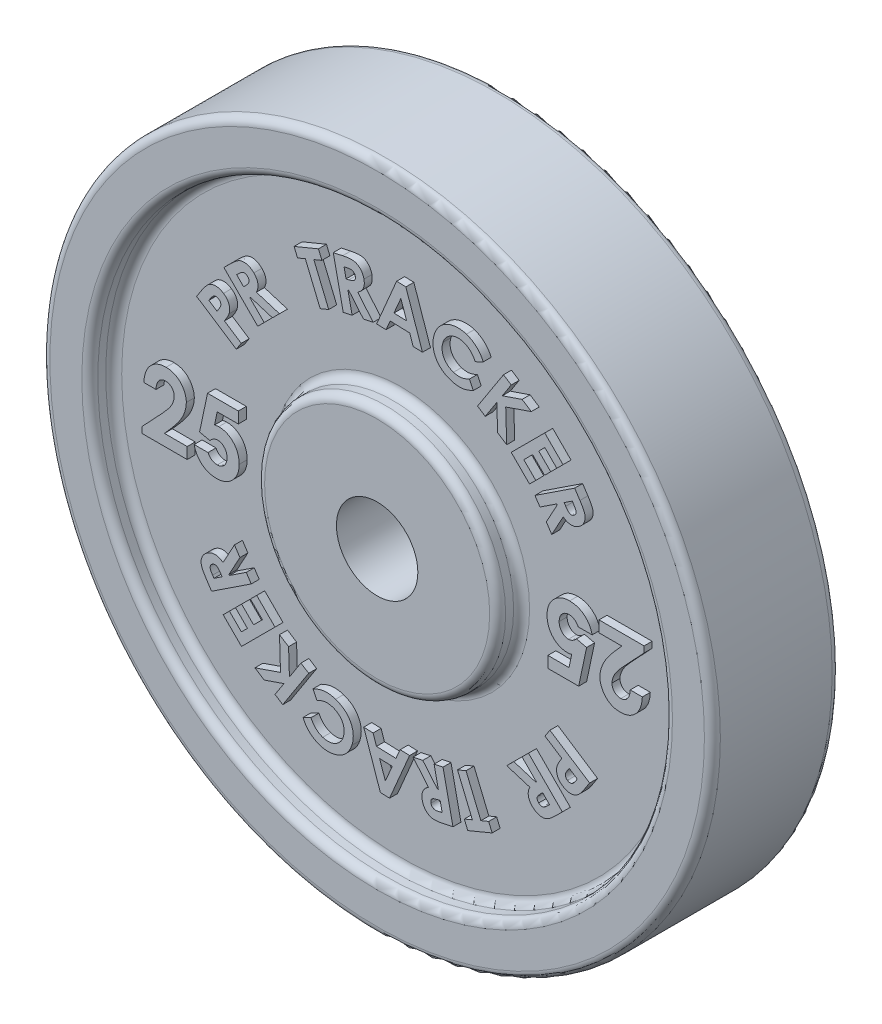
from build123d import *

# Parameters (mm, degrees)
ESBO_O1_R                = 21
ESBO_O1_R_2              = 2.55
RESSALTO_EXTRUS_O1_DEPTH = 8
ESBO_O2_R                = 18
ESBO_O2_R_2              = 7.55
CORTE_EXTRUS_O1_DEPTH    = 1.5
FILETE1_R                = 0.5
RESSALTO_EXTRUS_O2_DEPTH = 0.5
RESSALTO_EXTRUS_O3_DEPTH = 0.5
PADR_OCIRCULAR1_COUNT    = 2
FILETE2_R                = 0.5
FILETE3_R                = 0.5
RESSALTO_EXTRUS_O4_DEPTH = 0.5
RESSALTO_EXTRUS_O5_DEPTH = 0.5
PADR_OCIRCULAR2_COUNT    = 2


with BuildPart() as part:
    # Esbo_o1 → Ressalto-extrus_o1 (new body)
    with BuildSketch(Plane.XY):
        Circle(ESBO_O1_R)
        Circle(ESBO_O1_R_2, mode=Mode.SUBTRACT)
    extrude(amount=RESSALTO_EXTRUS_O1_DEPTH)

    # Esbo_o2 → Corte-extrus_o1 (cut)
    with BuildSketch(Plane.XY.offset(8)):
        Circle(ESBO_O2_R)
        Circle(ESBO_O2_R_2, mode=Mode.SUBTRACT)
    corte_extrus_o1 = extrude(amount=-CORTE_EXTRUS_O1_DEPTH, mode=Mode.SUBTRACT)

    # Filete1
    filete1_edges = [part.edges().sort_by_distance(p)[0] for p in [
        (-7.55, 0, 8),
        (-18, 0, 6.5),
        (-7.55, 0, 6.5),
        (-18, 0, 8),
    ]]
    fillet(filete1_edges, radius=FILETE1_R)

    # Esbo_o3 → Ressalto-extrus_o2 (add)
    # profile 1 of 9: a face of its own
    with BuildSketch(Plane.XY.offset(6.5)):
        with BuildLine():
            Line((11.372106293, 8.482696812), (11.70263514, 7.980893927))
            add(Edge.make_bspline(
                [(11.70263514, 7.980893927), (11.724196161, 7.947521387), (11.76576219, 7.883184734), (11.823642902, 7.789141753), (11.873676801, 7.700688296), (11.916269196, 7.618168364), (11.9531268, 7.542072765), (11.980870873, 7.471076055), (12.003586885, 7.406664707), (12.021625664, 7.328534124), (12.03179376, 7.234371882), (12.026669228, 7.122080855), (12.001764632, 7.010507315), (11.967025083, 6.919591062), (11.931859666, 6.848115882), (11.899674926, 6.79663945), (11.864071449, 6.746943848), (11.824230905, 6.699405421), (11.780243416, 6.653640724), (11.732185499, 6.609991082), (11.680364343, 6.567911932), (11.642951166, 6.542901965), (11.623909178, 6.530172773)],
                knots=[0, 0, 0, 0, 1.424579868, 2.746350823, 3.958867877, 5.067175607, 6.076040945, 6.988342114, 7.799210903, 8.522229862, 9.85875015, 11.181925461, 12.534388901, 13.939130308, 14.6618638, 15.387446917, 16.113030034, 16.852417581, 17.609320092, 18.387197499, 19.179140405, 20, 20, 20, 20], degree=3))
            add(Edge.make_bspline(
                [(11.623909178, 6.530172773), (11.603651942, 6.517253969), (11.563893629, 6.491898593), (11.502471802, 6.459700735), (11.441435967, 6.4320533), (11.380132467, 6.410855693), (11.319315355, 6.393320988), (11.258225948, 6.382908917), (11.197384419, 6.37656645), (11.136436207, 6.37605724), (11.075684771, 6.380787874), (11.01502661, 6.391326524), (10.954290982, 6.40654737), (10.894169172, 6.429160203), (10.833127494, 6.454272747), (10.77304555, 6.486804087), (10.712688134, 6.523926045), (10.673802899, 6.552333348), (10.653957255, 6.566831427)],
                knots=[0, 0, 0, 0, 1.102086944, 2.163035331, 3.179481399, 4.173821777, 5.137300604, 6.080390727, 7.013391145, 7.941897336, 8.873265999, 9.805722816, 10.76445368, 11.741476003, 12.750579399, 13.790977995, 14.872593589, 16, 16, 16, 16], degree=3))
            Line((10.653957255, 6.566831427), (9.936409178, 5.250124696))
            Line((9.936409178, 5.250124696), (9.595663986, 5.766951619))
            Line((9.595663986, 5.766951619), (10.279558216, 7.020557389))
            Line((10.279558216, 7.020557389), (10.250712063, 7.065028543))
            Line((10.250712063, 7.065028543), (9.197827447, 6.370917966))
            Line((9.197827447, 6.370917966), (8.885928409, 6.843874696))
            Line((8.885928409, 6.843874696), (11.372106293, 8.482696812))
        make_face()
        with BuildLine():
            Line((10.712250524, 7.369115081), (10.810207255, 7.220076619))
            add(Edge.make_bspline(
                [(10.810207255, 7.220076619), (10.82222925, 7.201908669), (10.845308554, 7.167030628), (10.881668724, 7.119046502), (10.916195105, 7.076232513), (10.949997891, 7.039374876), (10.982453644, 7.008009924), (11.013544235, 6.981619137), (11.044400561, 6.961738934), (11.083194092, 6.942255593), (11.134321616, 6.929880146), (11.19829258, 6.932687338), (11.264419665, 6.953846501), (11.305669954, 6.978554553), (11.32763514, 6.991711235)],
                knots=[0, 0, 0, 0, 1.203101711, 2.309662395, 3.324143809, 4.240453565, 5.070005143, 5.816667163, 6.488851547, 7.092611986, 8.2090873, 9.349703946, 10.588755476, 12, 12, 12, 12], degree=3))
            add(Edge.make_bspline(
                [(11.32763514, 6.991711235), (11.340342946, 7.000767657), (11.365409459, 7.01863171), (11.397276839, 7.051005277), (11.422317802, 7.087453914), (11.441728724, 7.126408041), (11.454266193, 7.167891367), (11.460187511, 7.210446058), (11.460451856, 7.253814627), (11.452661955, 7.300191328), (11.434169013, 7.353004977), (11.403911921, 7.416123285), (11.360818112, 7.491805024), (11.326138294, 7.545387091), (11.307202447, 7.574643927)],
                knots=[0, 0, 0, 0, 0.842179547, 1.661223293, 2.4389524, 3.223208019, 4.003944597, 4.769372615, 5.537932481, 6.338747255, 7.29721474, 8.551489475, 10.117047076, 12, 12, 12, 12], degree=3))
            Line((11.307202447, 7.574643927), (11.221264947, 7.705052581))
            Line((11.221264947, 7.705052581), (10.712250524, 7.369115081))
        make_face(mode=Mode.SUBTRACT)
    # profile 2 of 9: a face of its own
    with BuildSketch(Plane.XY.offset(6.5)):
        Polygon((9.497131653, 10.539133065), (10.643766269, 9.392498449), (10.252540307, 9.001272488), (9.503141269, 9.750671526), (9.123333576, 9.370863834), (9.872732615, 8.621464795), (9.488718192, 8.237450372), (8.739319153, 8.986849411), (8.187035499, 8.434565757), (8.936434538, 7.685166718), (8.544006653, 7.292738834), (7.397372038, 8.439373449), align=None)
    # profile 3 of 9: a face of its own
    with BuildSketch(Plane.XY.offset(6.5)):
        Polygon((6.914354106, 12.404591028), (7.398128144, 12.092091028), (6.838632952, 11.227307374), (8.080219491, 11.650384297), (8.655940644, 11.277788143), (7.053176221, 10.72550449), (7.11507526, 8.709278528), (6.547767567, 9.075865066), (6.494281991, 10.69425449), (5.771926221, 9.578268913), (5.288152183, 9.890768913), align=None)
    # profile 4 of 9: a face of its own
    with BuildSketch(Plane.XY.offset(6.5)):
        with BuildLine():
            Line((5.643245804, 12.465489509), (5.14564965, 12.22750874))
            add(Edge.make_bspline(
                [(5.14564965, 12.22750874), (5.124240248, 12.270637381), (5.08238287, 12.354957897), (5.00706436, 12.470935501), (4.925885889, 12.576147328), (4.8364413, 12.668755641), (4.740854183, 12.750845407), (4.636864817, 12.819650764), (4.526124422, 12.877448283), (4.447693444, 12.906043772), (4.408269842, 12.920417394)],
                knots=[0, 0, 0, 0, 1.108720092, 2.167651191, 3.18060078, 4.166538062, 5.129360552, 6.078037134, 7.033918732, 8, 8, 8, 8], degree=3))
            add(Edge.make_bspline(
                [(4.408269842, 12.920417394), (4.374572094, 12.930426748), (4.308244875, 12.950128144), (4.20743273, 12.969055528), (4.107941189, 12.976362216), (4.009462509, 12.975892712), (3.912242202, 12.963380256), (3.815944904, 12.941789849), (3.72111022, 12.909667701), (3.628914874, 12.867530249), (3.540271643, 12.818525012), (3.458639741, 12.760702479), (3.383840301, 12.69679356), (3.317503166, 12.624839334), (3.257358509, 12.547286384), (3.205773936, 12.461756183), (3.160882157, 12.369669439), (3.137626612, 12.304480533), (3.125817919, 12.271378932)],
                knots=[0, 0, 0, 0, 1.052060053, 2.070767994, 3.063437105, 4.035120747, 5.014106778, 5.991861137, 6.985689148, 8.005720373, 9.023421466, 10.013478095, 10.995783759, 11.96331235, 12.938580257, 13.929127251, 14.948452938, 16, 16, 16, 16], degree=3))
            add(Edge.make_bspline(
                [(3.125817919, 12.271378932), (3.118498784, 12.247826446), (3.104097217, 12.201483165), (3.088054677, 12.131334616), (3.075938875, 12.062137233), (3.067945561, 11.993527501), (3.06487748, 11.925441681), (3.066897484, 11.858001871), (3.072609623, 11.791291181), (3.083667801, 11.725686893), (3.098584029, 11.661415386), (3.117746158, 11.598917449), (3.141327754, 11.538489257), (3.169232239, 11.47995944), (3.200812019, 11.422929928), (3.237072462, 11.368310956), (3.277089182, 11.31540859), (3.321216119, 11.264964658), (3.368772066, 11.216562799), (3.419521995, 11.171968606), (3.473001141, 11.130439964), (3.529513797, 11.092992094), (3.588517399, 11.057556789), (3.650877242, 11.026911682), (3.715625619, 10.998527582), (3.760506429, 10.983385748), (3.783269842, 10.975705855)],
                knots=[0, 0, 0, 0, 1.08983963, 2.1444336, 3.178001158, 4.193971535, 5.19552419, 6.187598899, 7.174443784, 8.152670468, 9.125633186, 10.089121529, 11.039541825, 11.990127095, 12.953371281, 13.918526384, 14.88546701, 15.883372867, 16.878918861, 17.882661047, 18.867398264, 19.869381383, 20.877721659, 21.907298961, 22.938588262, 24, 24, 24, 24], degree=3))
            add(Edge.make_bspline(
                [(3.783269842, 10.975705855), (3.82212513, 10.96407343), (3.898580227, 10.941184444), (4.015139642, 10.921347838), (4.130158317, 10.915055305), (4.225424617, 10.918680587), (4.301950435, 10.930417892), (4.362185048, 10.942341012), (4.425160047, 10.95866318), (4.490718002, 10.979184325), (4.558828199, 11.004016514), (4.62946354, 11.032959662), (4.703130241, 11.065380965), (4.752502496, 11.089513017), (4.777861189, 11.101907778)],
                knots=[0, 0, 0, 0, 1.412340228, 2.779045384, 4.10748043, 5.421237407, 6.091506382, 6.803337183, 7.560088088, 8.35707087, 9.196132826, 10.085318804, 11.016576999, 12, 12, 12, 12], degree=3))
            Line((4.777861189, 11.101907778), (5.020048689, 10.599503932))
            add(Edge.make_bspline(
                [(5.020048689, 10.599503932), (4.986137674, 10.582965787), (4.91971388, 10.550571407), (4.819970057, 10.508372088), (4.723678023, 10.470788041), (4.630302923, 10.438698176), (4.539814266, 10.412426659), (4.452316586, 10.390824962), (4.367745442, 10.376061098), (4.285510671, 10.365955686), (4.204189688, 10.362076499), (4.122362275, 10.362044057), (4.039098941, 10.366209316), (3.95461992, 10.375168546), (3.868879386, 10.389396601), (3.781937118, 10.407109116), (3.69381468, 10.430250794), (3.635166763, 10.448440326), (3.605385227, 10.457677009)],
                knots=[0, 0, 0, 0, 1.235616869, 2.420286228, 3.546204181, 4.621062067, 5.653067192, 6.631820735, 7.5714333, 8.463446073, 9.343896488, 10.236271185, 11.14293321, 12.073336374, 13.017223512, 13.98880256, 14.978709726, 16, 16, 16, 16], degree=3))
            add(Edge.make_bspline(
                [(3.605385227, 10.457677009), (3.551727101, 10.476565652), (3.446398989, 10.513643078), (3.297649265, 10.584292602), (3.161014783, 10.665870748), (3.035742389, 10.757492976), (2.922155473, 10.860013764), (2.820622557, 10.973645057), (2.731387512, 11.098072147), (2.654896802, 11.231948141), (2.591081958, 11.372150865), (2.543576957, 11.517568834), (2.51058845, 11.665663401), (2.494729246, 11.817233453), (2.49340558, 11.971430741), (2.508187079, 12.128829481), (2.538861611, 12.289174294), (2.570587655, 12.395221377), (2.586755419, 12.449263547)],
                knots=[0, 0, 0, 0, 1.087256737, 2.134228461, 3.142668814, 4.126448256, 5.097398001, 6.063225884, 7.034900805, 8.019872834, 9.007433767, 9.975333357, 10.94012752, 11.903376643, 12.884071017, 13.884292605, 14.921823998, 16, 16, 16, 16], degree=3))
            add(Edge.make_bspline(
                [(2.586755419, 12.449263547), (2.598710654, 12.484095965), (2.622351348, 12.552974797), (2.665512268, 12.65208616), (2.712703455, 12.746597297), (2.765297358, 12.83581344), (2.822358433, 12.920395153), (2.885131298, 12.999649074), (2.952295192, 13.074640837), (3.025439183, 13.143444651), (3.102079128, 13.208027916), (3.183365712, 13.26630797), (3.268736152, 13.318674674), (3.357150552, 13.366279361), (3.450083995, 13.4073008), (3.546606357, 13.442756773), (3.647299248, 13.471979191), (3.750740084, 13.496147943), (3.856160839, 13.5133832), (3.962121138, 13.524247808), (4.067899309, 13.528599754), (4.173333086, 13.525669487), (4.278030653, 13.51504725), (4.38247792, 13.499035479), (4.486764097, 13.475736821), (4.555235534, 13.454541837), (4.589760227, 13.443854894)],
                knots=[0, 0, 0, 0, 1.061962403, 2.099961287, 3.115586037, 4.107642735, 5.085323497, 6.056407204, 7.021973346, 7.986605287, 8.950665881, 9.911273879, 10.868678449, 11.838127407, 12.805645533, 13.796506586, 14.802219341, 15.828295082, 16.859046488, 17.881389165, 18.899230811, 19.910902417, 20.921170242, 21.932973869, 22.95776332, 24, 24, 24, 24], degree=3))
            add(Edge.make_bspline(
                [(4.589760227, 13.443854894), (4.618936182, 13.433780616), (4.676886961, 13.413770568), (4.761345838, 13.377748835), (4.843666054, 13.338236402), (4.923879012, 13.294368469), (5.001343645, 13.245522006), (5.076553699, 13.192561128), (5.149572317, 13.135420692), (5.219496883, 13.073515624), (5.286779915, 13.008408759), (5.349692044, 12.939580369), (5.409691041, 12.868696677), (5.464914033, 12.794246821), (5.515403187, 12.716290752), (5.562227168, 12.635625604), (5.605999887, 12.552367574), (5.630803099, 12.494512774), (5.643245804, 12.465489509)],
                knots=[0, 0, 0, 0, 0.998866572, 1.984000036, 2.970072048, 3.953860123, 4.941572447, 5.932833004, 6.93037271, 7.941144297, 8.954553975, 9.959547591, 10.958329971, 11.959530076, 12.957722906, 13.963113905, 14.978181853, 16, 16, 16, 16], degree=3))
        make_face()
    # profile 5 of 9: a face of its own
    with BuildSketch(Plane.XY.offset(6.5)):
        Polygon((0.221709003, 14.132780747), (0.798031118, 14.112949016), (1.841300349, 11.088910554), (1.251156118, 11.109343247), (1.039617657, 11.732540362), (-0.177329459, 11.775208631), (-0.442353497, 11.168838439), (-1.03309869, 11.189271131), align=None)
        Polygon((0.48613208, 13.331098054), (0.05283881, 12.320881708), (0.84550708, 12.293237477), align=None, mode=Mode.SUBTRACT)
    # profile 6 of 9: a face of its own
    with BuildSketch(Plane.XY.offset(6.5)):
        with BuildLine():
            Line((-3.748977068, 13.699248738), (-3.157630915, 13.825450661))
            add(Edge.make_bspline(
                [(-3.157630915, 13.825450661), (-3.11861599, 13.833511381), (-3.043380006, 13.849055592), (-2.934083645, 13.867484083), (-2.832907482, 13.882026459), (-2.739971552, 13.892808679), (-2.655085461, 13.897468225), (-2.578472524, 13.898277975), (-2.509931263, 13.895221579), (-2.448440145, 13.886614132), (-2.392018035, 13.873700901), (-2.338344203, 13.856855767), (-2.286494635, 13.835739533), (-2.236425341, 13.810444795), (-2.18841238, 13.780791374), (-2.141582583, 13.747562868), (-2.096919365, 13.709826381), (-2.054116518, 13.66827923), (-2.014059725, 13.623221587), (-1.976360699, 13.575329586), (-1.943582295, 13.523161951), (-1.91349983, 13.46837792), (-1.886135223, 13.410817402), (-1.863720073, 13.349652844), (-1.843355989, 13.285833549), (-1.833382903, 13.241604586), (-1.828303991, 13.219080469)],
                knots=[0, 0, 0, 0, 1.704973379, 3.287853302, 4.742851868, 6.079738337, 7.290568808, 8.379457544, 9.358207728, 10.223935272, 11.033000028, 11.832927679, 12.628986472, 13.426521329, 14.230847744, 15.042135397, 15.881916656, 16.730752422, 17.592991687, 18.460754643, 19.335982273, 20.226199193, 21.135209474, 22.060410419, 23.012241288, 24, 24, 24, 24], degree=3))
            add(Edge.make_bspline(
                [(-1.828303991, 13.219080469), (-1.823872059, 13.195484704), (-1.815156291, 13.14908165), (-1.806151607, 13.079895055), (-1.804393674, 13.012561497), (-1.805508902, 12.947236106), (-1.813270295, 12.884248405), (-1.824014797, 12.822858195), (-1.842141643, 12.764069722), (-1.863436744, 12.706792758), (-1.890100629, 12.651605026), (-1.922242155, 12.59876618), (-1.958776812, 12.547363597), (-2.001295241, 12.498744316), (-2.048305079, 12.451798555), (-2.100051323, 12.406492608), (-2.157370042, 12.363888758), (-2.198138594, 12.337636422), (-2.218928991, 12.324248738)],
                knots=[0, 0, 0, 0, 1.09581435, 2.155011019, 3.179669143, 4.167483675, 5.133737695, 6.073368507, 7.007780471, 7.936629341, 8.860786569, 9.800016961, 10.756576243, 11.735379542, 12.74392103, 13.787214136, 14.871564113, 16, 16, 16, 16], degree=3))
            Line((-2.218928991, 12.324248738), (-1.24957803, 11.169801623))
            Line((-1.24957803, 11.169801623), (-1.858352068, 11.040594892))
            Line((-1.858352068, 11.040594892), (-2.78082803, 12.140955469))
            Line((-2.78082803, 12.140955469), (-2.832510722, 12.130138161))
            Line((-2.832510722, 12.130138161), (-2.569289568, 10.889753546))
            Line((-2.569289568, 10.889753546), (-3.126981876, 10.770763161))
            Line((-3.126981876, 10.770763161), (-3.748977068, 13.699248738))
        make_face()
        with BuildLine():
            Line((-2.947895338, 12.673407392), (-2.77301553, 12.710066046))
            add(Edge.make_bspline(
                [(-2.77301553, 12.710066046), (-2.751752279, 12.714951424), (-2.710882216, 12.724341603), (-2.652449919, 12.739833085), (-2.599637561, 12.7564915), (-2.55256387, 12.774327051), (-2.511544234, 12.793726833), (-2.475741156, 12.813396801), (-2.445380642, 12.834177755), (-2.420718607, 12.857047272), (-2.400569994, 12.881222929), (-2.384681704, 12.907606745), (-2.372570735, 12.936138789), (-2.364310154, 12.966885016), (-2.3592735, 12.999749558), (-2.35908776, 13.034847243), (-2.361960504, 13.072080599), (-2.366720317, 13.097320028), (-2.369169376, 13.11030643)],
                knots=[0, 0, 0, 0, 1.598184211, 3.071867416, 4.427024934, 5.653385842, 6.756228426, 7.748257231, 8.643888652, 9.443485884, 10.204445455, 10.941834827, 11.691389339, 12.467479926, 13.268557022, 14.119810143, 15.03258895, 16, 16, 16, 16], degree=3))
            add(Edge.make_bspline(
                [(-2.369169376, 13.11030643), (-2.372857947, 13.125700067), (-2.380042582, 13.155683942), (-2.399338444, 13.197067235), (-2.423545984, 13.234165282), (-2.452965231, 13.266917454), (-2.487429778, 13.29339287), (-2.524430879, 13.316209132), (-2.56574844, 13.330438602), (-2.602384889, 13.339094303), (-2.634940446, 13.342056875), (-2.663868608, 13.342735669), (-2.696718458, 13.340386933), (-2.733862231, 13.337731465), (-2.774906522, 13.332025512), (-2.82036844, 13.324713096), (-2.869883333, 13.315816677), (-2.904241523, 13.308704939), (-2.922053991, 13.305017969)],
                knots=[0, 0, 0, 0, 1.131166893, 2.203297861, 3.249782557, 4.295873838, 5.337726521, 6.353877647, 7.393258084, 8.45137998, 9.042365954, 9.731131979, 10.521344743, 11.399396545, 12.397667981, 13.487316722, 14.697338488, 16, 16, 16, 16], degree=3))
            Line((-2.922053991, 13.305017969), (-3.075299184, 13.272566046))
            Line((-3.075299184, 13.272566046), (-2.947895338, 12.673407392))
        make_face(mode=Mode.SUBTRACT)
    # profile 7 of 9: a face of its own
    with BuildSketch(Plane.XY.offset(6.5)):
        Polygon((-6.202171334, 12.807926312), (-4.675128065, 13.440738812), (-4.459983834, 12.922109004), (-4.963589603, 12.712974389), (-4.033902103, 10.468984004), (-4.566954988, 10.24843112), (-5.496642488, 12.492421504), (-5.987027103, 12.289296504), align=None)
    # profile 8 of 9: a face of its own
    with BuildSketch(Plane.XY.offset(6.5)):
        with BuildLine():
            Line((-10.599505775, 9.467272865), (-10.169818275, 9.895758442))
            add(Edge.make_bspline(
                [(-10.169818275, 9.895758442), (-10.141316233, 9.923753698), (-10.086316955, 9.977775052), (-10.004693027, 10.053245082), (-9.927847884, 10.121209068), (-9.854635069, 10.179596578), (-9.786650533, 10.230950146), (-9.722492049, 10.272906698), (-9.66276536, 10.307043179), (-9.58963716, 10.341521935), (-9.498181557, 10.370464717), (-9.385940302, 10.386720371), (-9.270852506, 10.385232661), (-9.174136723, 10.36969788), (-9.097020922, 10.348445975), (-9.039330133, 10.327835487), (-8.983116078, 10.302648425), (-8.927889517, 10.272904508), (-8.874022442, 10.238562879), (-8.820893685, 10.200242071), (-8.769754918, 10.156522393), (-8.73697313, 10.125088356), (-8.720299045, 10.109099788)],
                knots=[0, 0, 0, 0, 1.421133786, 2.742306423, 3.954344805, 5.069496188, 6.072872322, 6.984049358, 7.794588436, 8.518273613, 9.856972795, 11.189283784, 12.536208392, 13.936227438, 14.660613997, 15.379652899, 16.113338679, 16.849856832, 17.609021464, 18.384434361, 19.178260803, 20, 20, 20, 20], degree=3))
            add(Edge.make_bspline(
                [(-8.720299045, 10.109099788), (-8.703367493, 10.091744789), (-8.670215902, 10.057764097), (-8.626574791, 10.003113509), (-8.587171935, 9.948329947), (-8.552602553, 9.892608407), (-8.524439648, 9.835297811), (-8.501444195, 9.777178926), (-8.483314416, 9.718356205), (-8.470503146, 9.658431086), (-8.463587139, 9.597468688), (-8.460710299, 9.53555021), (-8.464938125, 9.472467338), (-8.473067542, 9.408335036), (-8.487039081, 9.343233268), (-8.506670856, 9.277286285), (-8.530984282, 9.210072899), (-8.551304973, 9.165854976), (-8.561645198, 9.143354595)],
                knots=[0, 0, 0, 0, 1.103197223, 2.160034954, 3.179906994, 4.174678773, 5.141294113, 6.082891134, 7.017573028, 7.940524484, 8.868105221, 9.808155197, 10.758194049, 11.742332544, 12.749361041, 13.785374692, 14.873083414, 16, 16, 16, 16], degree=3))
            Line((-8.561645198, 9.143354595), (-7.116332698, 8.698643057))
            Line((-7.116332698, 8.698643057), (-7.558640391, 8.258138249))
            Line((-7.558640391, 8.258138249), (-8.934842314, 8.681816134))
            Line((-8.934842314, 8.681816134), (-8.972101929, 8.644556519))
            Line((-8.972101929, 8.644556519), (-8.074866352, 7.743715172))
            Line((-8.074866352, 7.743715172), (-8.479914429, 7.339869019))
            Line((-8.479914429, 7.339869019), (-10.599505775, 9.467272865))
        make_face()
        with BuildLine():
            Line((-9.365731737, 9.039388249), (-9.238928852, 9.165590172))
            add(Edge.make_bspline(
                [(-9.238928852, 9.165590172), (-9.223627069, 9.181339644), (-9.1941939, 9.211633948), (-9.153196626, 9.256307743), (-9.118169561, 9.299445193), (-9.087893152, 9.33978526), (-9.063884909, 9.378651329), (-9.04410206, 9.414677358), (-9.030162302, 9.448956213), (-9.018589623, 9.491275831), (-9.016852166, 9.544258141), (-9.031818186, 9.607060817), (-9.066072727, 9.668099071), (-9.098869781, 9.703716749), (-9.116332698, 9.722681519)],
                knots=[0, 0, 0, 0, 1.202674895, 2.313360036, 3.319177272, 4.245179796, 5.073189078, 5.819223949, 6.493567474, 7.094979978, 8.214892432, 9.353828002, 10.591035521, 12, 12, 12, 12], degree=3))
            add(Edge.make_bspline(
                [(-9.116332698, 9.722681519), (-9.127824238, 9.733508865), (-9.150421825, 9.754800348), (-9.189346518, 9.779172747), (-9.230006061, 9.797904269), (-9.272853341, 9.80847089), (-9.316140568, 9.812471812), (-9.359674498, 9.811300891), (-9.402203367, 9.800892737), (-9.43762212, 9.788141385), (-9.46625409, 9.772592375), (-9.490907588, 9.757895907), (-9.517199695, 9.737993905), (-9.546842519, 9.715441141), (-9.578406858, 9.688202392), (-9.612880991, 9.65736726), (-9.649898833, 9.622852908), (-9.674898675, 9.597956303), (-9.687847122, 9.585061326)],
                knots=[0, 0, 0, 0, 1.125004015, 2.212269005, 3.262387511, 4.310165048, 5.344972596, 6.361525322, 7.402641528, 8.457426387, 9.039724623, 9.726656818, 10.504926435, 11.391944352, 12.386519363, 13.4806323, 14.695115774, 16, 16, 16, 16], degree=3))
            Line((-9.687847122, 9.585061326), (-9.799025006, 9.474484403))
            Line((-9.799025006, 9.474484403), (-9.365731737, 9.039388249))
        make_face(mode=Mode.SUBTRACT)
    # profile 9 of 9: a face of its own
    with BuildSketch(Plane.XY.offset(6.5)):
        with BuildLine():
            Line((-12.308870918, 7.044325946), (-11.98134688, 7.546128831))
            add(Edge.make_bspline(
                [(-11.98134688, 7.546128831), (-11.959636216, 7.578665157), (-11.917812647, 7.641343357), (-11.855330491, 7.730623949), (-11.794968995, 7.811310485), (-11.735855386, 7.882605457), (-11.68030535, 7.94608901), (-11.626652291, 8.000619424), (-11.575068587, 8.046433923), (-11.52510025, 8.084536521), (-11.475246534, 8.115763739), (-11.425066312, 8.142230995), (-11.373249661, 8.163866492), (-11.320451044, 8.182383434), (-11.265729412, 8.194956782), (-11.210059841, 8.20521918), (-11.152905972, 8.209628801), (-11.074873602, 8.210581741), (-10.975389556, 8.200198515), (-10.856174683, 8.170027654), (-10.737536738, 8.119701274), (-10.662507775, 8.074349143), (-10.623774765, 8.050936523)],
                knots=[0, 0, 0, 0, 1.407136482, 2.710717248, 3.919990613, 5.030955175, 6.041784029, 6.953954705, 7.781053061, 8.521898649, 9.211703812, 9.895079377, 10.560316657, 11.230338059, 11.905032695, 12.577993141, 13.26504473, 13.964123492, 15.383954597, 16.848671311, 18.373155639, 20, 20, 20, 20], degree=3))
            add(Edge.make_bspline(
                [(-10.623774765, 8.050936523), (-10.602739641, 8.036594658), (-10.561692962, 8.0086088), (-10.504605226, 7.962631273), (-10.45359978, 7.913595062), (-10.406916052, 7.863064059), (-10.367281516, 7.808759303), (-10.331957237, 7.752813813), (-10.302615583, 7.694018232), (-10.279094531, 7.632979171), (-10.261259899, 7.570345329), (-10.247856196, 7.50671609), (-10.240040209, 7.441975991), (-10.237618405, 7.376441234), (-10.240851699, 7.310158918), (-10.248630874, 7.243056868), (-10.261786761, 7.174910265), (-10.274673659, 7.129776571), (-10.281226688, 7.106825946)],
                knots=[0, 0, 0, 0, 1.124608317, 2.194493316, 3.233698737, 4.248804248, 5.229486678, 6.199567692, 7.169325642, 8.127585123, 9.085599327, 10.043777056, 10.997776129, 11.963162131, 12.9377548, 13.92690783, 14.945826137, 16, 16, 16, 16], degree=3))
            add(Edge.make_bspline(
                [(-10.281226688, 7.106825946), (-10.286271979, 7.092141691), (-10.297181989, 7.060388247), (-10.318515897, 7.010437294), (-10.346025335, 6.954630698), (-10.378136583, 6.891893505), (-10.417824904, 6.823723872), (-10.461958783, 6.748474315), (-10.512639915, 6.667567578), (-10.548589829, 6.611791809), (-10.56728438, 6.582787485)],
                knots=[0, 0, 0, 0, 0.622537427, 1.346183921, 2.176173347, 3.117576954, 4.171813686, 5.338785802, 6.616124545, 8, 8, 8, 8], degree=3))
            Line((-10.56728438, 6.582787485), (-9.514399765, 5.896489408))
            Line((-9.514399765, 5.896489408), (-9.822693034, 5.423532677))
            Line((-9.822693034, 5.423532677), (-12.308870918, 7.044325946))
        make_face()
        with BuildLine():
            Line((-11.028822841, 6.883869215), (-10.930265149, 7.034710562))
            add(Edge.make_bspline(
                [(-10.930265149, 7.034710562), (-10.912702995, 7.062157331), (-10.880443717, 7.112573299), (-10.840977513, 7.184219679), (-10.811208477, 7.243531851), (-10.794506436, 7.294263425), (-10.787318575, 7.338945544), (-10.787502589, 7.380666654), (-10.793223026, 7.421802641), (-10.806926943, 7.461344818), (-10.825809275, 7.499358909), (-10.8519373, 7.534169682), (-10.883729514, 7.566495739), (-10.90929918, 7.583999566), (-10.922452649, 7.593003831)],
                knots=[0, 0, 0, 0, 1.82986352, 3.361209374, 4.594483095, 5.551825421, 6.349238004, 7.125730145, 7.888067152, 8.670975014, 9.466161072, 10.26293814, 11.106426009, 12, 12, 12, 12], degree=3))
            add(Edge.make_bspline(
                [(-10.922452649, 7.593003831), (-10.934309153, 7.600318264), (-10.957170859, 7.614421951), (-10.993212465, 7.630081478), (-11.028808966, 7.641335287), (-11.064689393, 7.646638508), (-11.100257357, 7.647302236), (-11.135694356, 7.643086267), (-11.17099314, 7.633435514), (-11.193419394, 7.622991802), (-11.204904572, 7.617643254)],
                knots=[0, 0, 0, 0, 1.120226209, 2.160019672, 3.154816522, 4.117323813, 5.068961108, 6.011122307, 6.981434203, 8, 8, 8, 8], degree=3))
            add(Edge.make_bspline(
                [(-11.204904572, 7.617643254), (-11.213847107, 7.612843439), (-11.232650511, 7.602750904), (-11.260106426, 7.582112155), (-11.288481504, 7.556232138), (-11.318961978, 7.525451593), (-11.349627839, 7.488436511), (-11.383023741, 7.447308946), (-11.416466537, 7.399919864), (-11.438948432, 7.366486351), (-11.450697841, 7.349013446)],
                knots=[0, 0, 0, 0, 0.661727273, 1.391409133, 2.234074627, 3.167977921, 4.216097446, 5.369899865, 6.625466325, 8, 8, 8, 8], degree=3))
            Line((-11.450697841, 7.349013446), (-11.537837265, 7.215599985))
            Line((-11.537837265, 7.215599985), (-11.028822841, 6.883869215))
        make_face(mode=Mode.SUBTRACT)
    ressalto_extrus_o2 = extrude(amount=RESSALTO_EXTRUS_O2_DEPTH)

    # Esbo_o5 → Ressalto-extrus_o3 (add)
    with BuildSketch(Plane.XY.offset(6.5)):
        with BuildLine():
            Line((-14.851889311, 0.722222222), (-15.611718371, 0.722222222))
            add(Edge.make_bspline(
                [(-15.611718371, 0.722222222), (-15.608436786, 0.779699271), (-15.602024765, 0.892005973), (-15.576519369, 1.055135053), (-15.542343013, 1.209274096), (-15.496730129, 1.353883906), (-15.439414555, 1.488911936), (-15.37187117, 1.614818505), (-15.292374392, 1.730940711), (-15.202616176, 1.836718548), (-15.104120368, 1.931612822), (-14.998931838, 2.015752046), (-14.885441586, 2.085181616), (-14.765723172, 2.142315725), (-14.639796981, 2.187963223), (-14.506471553, 2.218482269), (-14.366901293, 2.239150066), (-14.271354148, 2.240958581), (-14.222655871, 2.241880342)],
                knots=[0, 0, 0, 0, 1.199038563, 2.342849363, 3.436047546, 4.486744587, 5.497670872, 6.488682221, 7.459191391, 8.424610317, 9.374430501, 10.305433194, 11.225809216, 12.140057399, 13.06607119, 14.010487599, 14.985989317, 16, 16, 16, 16], degree=3))
            add(Edge.make_bspline(
                [(-14.222655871, 2.241880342), (-14.162879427, 2.240015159), (-14.0461818, 2.236373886), (-13.876610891, 2.205312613), (-13.718250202, 2.153357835), (-13.571214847, 2.080763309), (-13.436756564, 1.988539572), (-13.314897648, 1.87857786), (-13.209323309, 1.748571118), (-13.119364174, 1.603928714), (-13.044618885, 1.450772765), (-12.992240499, 1.292403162), (-12.95781275, 1.133022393), (-12.954140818, 1.025703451), (-12.952316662, 0.972389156)],
                knots=[0, 0, 0, 0, 1.075374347, 2.099382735, 3.09057751, 4.06680945, 5.040638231, 6.016817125, 7.011024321, 8.044445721, 9.0776792, 10.070479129, 11.0414456, 12, 12, 12, 12], degree=3))
            add(Edge.make_bspline(
                [(-12.952316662, 0.972389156), (-12.953026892, 0.940140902), (-12.954456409, 0.875233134), (-12.964396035, 0.777011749), (-12.979307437, 0.676961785), (-13.001790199, 0.575169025), (-13.029828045, 0.471604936), (-13.063842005, 0.365959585), (-13.104621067, 0.258831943), (-13.151484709, 0.149016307), (-13.207393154, 0.036156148), (-13.272490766, -0.081440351), (-13.348505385, -0.203668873), (-13.434518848, -0.331219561), (-13.530948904, -0.463891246), (-13.638266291, -0.601284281), (-13.755234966, -0.743882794), (-13.838250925, -0.839201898), (-13.880902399, -0.888174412)],
                knots=[0, 0, 0, 0, 0.728284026, 1.46585585, 2.227944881, 3.01186502, 3.81876927, 4.650621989, 5.517437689, 6.406905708, 7.346299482, 8.360816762, 9.441613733, 10.596154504, 11.834900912, 13.145207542, 14.533280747, 16, 16, 16, 16], degree=3))
            Line((-13.880902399, -0.888174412), (-14.322722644, -1.394444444))
            Line((-14.322722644, -1.394444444), (-12.898043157, -1.394444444))
            Line((-12.898043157, -1.394444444), (-12.898043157, -2.1))
            Line((-12.898043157, -2.1), (-15.72026538, -2.1))
            Line((-15.72026538, -2.1), (-15.72026538, -1.714997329))
            Line((-15.72026538, -1.714997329), (-14.46688664, -0.381056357))
            add(Edge.make_bspline(
                [(-14.46688664, -0.381056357), (-14.430598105, -0.342144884), (-14.360317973, -0.266784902), (-14.260316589, -0.15611075), (-14.169824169, -0.051083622), (-14.090717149, 0.04941481), (-14.018844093, 0.142124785), (-13.957409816, 0.229840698), (-13.905852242, 0.311769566), (-13.849879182, 0.410561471), (-13.796723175, 0.528388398), (-13.747949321, 0.664129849), (-13.718218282, 0.793867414), (-13.714114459, 0.8784072), (-13.712145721, 0.918963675)],
                knots=[0, 0, 0, 0, 1.246127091, 2.413378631, 3.493388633, 4.492180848, 5.408488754, 6.240484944, 6.999099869, 7.674939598, 8.898438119, 10.020720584, 11.050475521, 12, 12, 12, 12], degree=3))
            add(Edge.make_bspline(
                [(-13.712145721, 0.918963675), (-13.713617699, 0.958198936), (-13.71646989, 1.034223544), (-13.747813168, 1.142368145), (-13.79637126, 1.240282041), (-13.86479647, 1.325039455), (-13.94768083, 1.394690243), (-14.043461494, 1.446494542), (-14.151357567, 1.476385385), (-14.22699477, 1.48012665), (-14.26590507, 1.482051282)],
                knots=[0, 0, 0, 0, 1.062038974, 2.057870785, 3.028805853, 4.01125022, 4.991535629, 5.949134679, 6.94496649, 8, 8, 8, 8], degree=3))
            add(Edge.make_bspline(
                [(-14.26590507, 1.482051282), (-14.286006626, 1.4813403), (-14.325579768, 1.479940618), (-14.383749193, 1.470623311), (-14.43910158, 1.454202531), (-14.492253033, 1.432200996), (-14.542636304, 1.403037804), (-14.59012431, 1.367089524), (-14.6352174, 1.325269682), (-14.677708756, 1.277709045), (-14.716381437, 1.22463136), (-14.750730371, 1.166521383), (-14.779131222, 1.103415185), (-14.804136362, 1.036145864), (-14.823421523, 0.963990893), (-14.837463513, 0.887382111), (-14.8481387, 0.806444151), (-14.850616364, 0.750806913), (-14.851889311, 0.722222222)],
                knots=[0, 0, 0, 0, 0.903469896, 1.778625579, 2.63899355, 3.493148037, 4.358286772, 5.247621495, 6.164656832, 7.118446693, 8.109501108, 9.111810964, 10.146451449, 11.215617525, 12.33435995, 13.498009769, 14.714554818, 16, 16, 16, 16], degree=3))
        make_face()
        with BuildLine():
            Line((-11.62346383, 2.133333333), (-9.695906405, 2.133333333))
            Line((-9.695906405, 2.133333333), (-9.695906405, 1.427777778))
            Line((-9.695906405, 1.427777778), (-11.021367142, 1.427777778))
            Line((-11.021367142, 1.427777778), (-11.186731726, 0.62724359))
            add(Edge.make_bspline(
                [(-11.186731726, 0.62724359), (-11.164198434, 0.633519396), (-11.119758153, 0.645896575), (-11.052808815, 0.65830932), (-10.987925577, 0.666354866), (-10.945349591, 0.667428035), (-10.924692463, 0.667948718)],
                knots=[0, 0, 0, 0, 1.05461699, 2.079921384, 3.068411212, 4, 4, 4, 4], degree=3))
            add(Edge.make_bspline(
                [(-10.924692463, 0.667948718), (-10.879678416, 0.666917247), (-10.790945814, 0.664883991), (-10.661141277, 0.645581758), (-10.536845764, 0.615181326), (-10.418439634, 0.571824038), (-10.306038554, 0.515393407), (-10.199506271, 0.447128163), (-10.098712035, 0.366908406), (-10.005446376, 0.274683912), (-9.919749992, 0.173419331), (-9.845241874, 0.06389097), (-9.781607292, -0.052339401), (-9.730994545, -0.175994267), (-9.691046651, -0.306296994), (-9.66217941, -0.443331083), (-9.645108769, -0.587258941), (-9.642806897, -0.685450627), (-9.641632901, -0.735530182)],
                knots=[0, 0, 0, 0, 1.01440847, 1.999622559, 2.951875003, 3.895578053, 4.836219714, 5.782137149, 6.743708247, 7.735272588, 8.734977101, 9.730283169, 10.717124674, 11.717316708, 12.737475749, 13.78628267, 14.87096371, 16, 16, 16, 16], degree=3))
            add(Edge.make_bspline(
                [(-9.641632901, -0.735530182), (-9.643067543, -0.786178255), (-9.645898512, -0.886121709), (-9.664367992, -1.033073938), (-9.696966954, -1.173820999), (-9.741744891, -1.308739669), (-9.800736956, -1.436838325), (-9.871682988, -1.559443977), (-9.955782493, -1.675646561), (-10.052210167, -1.784254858), (-10.157039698, -1.883524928), (-10.268658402, -1.970852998), (-10.386282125, -2.044338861), (-10.509913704, -2.103727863), (-10.638843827, -2.150715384), (-10.773111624, -2.184920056), (-10.91336962, -2.204534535), (-11.008586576, -2.20719482), (-11.05698413, -2.208547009)],
                knots=[0, 0, 0, 0, 1.06808661, 2.107647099, 3.116961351, 4.110378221, 5.100014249, 6.085620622, 7.093190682, 8.119403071, 9.144090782, 10.133780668, 11.103064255, 12.062861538, 13.020824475, 13.992378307, 14.979551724, 16, 16, 16, 16], degree=3))
            add(Edge.make_bspline(
                [(-11.05698413, -2.208547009), (-11.100264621, -2.207440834), (-11.185622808, -2.205259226), (-11.311351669, -2.191849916), (-11.432568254, -2.16814213), (-11.548629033, -2.133830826), (-11.660755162, -2.091601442), (-11.767650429, -2.038785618), (-11.869902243, -1.976389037), (-11.967220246, -1.905550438), (-12.058023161, -1.825753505), (-12.140898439, -1.738402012), (-12.216347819, -1.644596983), (-12.282756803, -1.54318115), (-12.339917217, -1.434304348), (-12.390608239, -1.319249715), (-12.432099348, -1.196815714), (-12.45315489, -1.111937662), (-12.463855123, -1.068803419)],
                knots=[0, 0, 0, 0, 1.054957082, 2.080596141, 3.077793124, 4.061112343, 5.027190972, 5.994718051, 6.962465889, 7.943658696, 8.924948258, 9.904494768, 10.875059, 11.855380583, 12.854004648, 13.869083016, 14.917087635, 16, 16, 16, 16], degree=3))
            Line((-12.463855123, -1.068803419), (-11.595479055, -1.068803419))
            add(Edge.make_bspline(
                [(-11.595479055, -1.068803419), (-11.579605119, -1.098693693), (-11.548755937, -1.15678203), (-11.490073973, -1.233903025), (-11.424383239, -1.299668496), (-11.352276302, -1.354720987), (-11.273285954, -1.395965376), (-11.190630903, -1.427243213), (-11.103272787, -1.445317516), (-11.043778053, -1.447576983), (-11.013734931, -1.448717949)],
                knots=[0, 0, 0, 0, 1.104910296, 2.147267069, 3.153527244, 4.136738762, 5.099945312, 6.05603338, 7.018353, 8, 8, 8, 8], degree=3))
            add(Edge.make_bspline(
                [(-11.013734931, -1.448717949), (-10.992795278, -1.447930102), (-10.951596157, -1.44638), (-10.890895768, -1.438179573), (-10.832954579, -1.42264815), (-10.777341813, -1.40114074), (-10.723908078, -1.374318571), (-10.673419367, -1.340457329), (-10.624997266, -1.301481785), (-10.579378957, -1.256757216), (-10.538061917, -1.206899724), (-10.501831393, -1.153324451), (-10.469436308, -1.09722185), (-10.445440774, -1.036369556), (-10.42579046, -0.972584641), (-10.411319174, -0.905385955), (-10.402670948, -0.834695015), (-10.401870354, -0.786436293), (-10.401461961, -0.76181891)],
                knots=[0, 0, 0, 0, 0.978869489, 1.925942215, 2.855067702, 3.774946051, 4.70828698, 5.642468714, 6.60995405, 7.609372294, 8.622401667, 9.629904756, 10.629323, 11.642352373, 12.678539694, 13.745912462, 14.850161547, 16, 16, 16, 16], degree=3))
            add(Edge.make_bspline(
                [(-10.401461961, -0.76181891), (-10.401935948, -0.737772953), (-10.402858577, -0.690966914), (-10.410490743, -0.622238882), (-10.424144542, -0.557028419), (-10.442747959, -0.494836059), (-10.466562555, -0.436039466), (-10.495665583, -0.380288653), (-10.530181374, -0.327865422), (-10.570295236, -0.279837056), (-10.613072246, -0.235784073), (-10.6590285, -0.197255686), (-10.707749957, -0.165279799), (-10.757722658, -0.13736392), (-10.810941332, -0.117047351), (-10.866209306, -0.10305608), (-10.923468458, -0.092789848), (-10.962523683, -0.092186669), (-10.982358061, -0.091880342)],
                knots=[0, 0, 0, 0, 1.166249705, 2.270133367, 3.348514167, 4.393962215, 5.415026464, 6.420877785, 7.440098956, 8.453121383, 9.451844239, 10.415694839, 11.355045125, 12.27538808, 13.187007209, 14.108269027, 15.039275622, 16, 16, 16, 16], degree=3))
            add(Edge.make_bspline(
                [(-10.982358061, -0.091880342), (-11.003902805, -0.092697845), (-11.047083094, -0.094336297), (-11.111238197, -0.107667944), (-11.174619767, -0.12924355), (-11.237580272, -0.159010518), (-11.299494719, -0.197966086), (-11.361997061, -0.243656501), (-11.422995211, -0.299401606), (-11.461779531, -0.340920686), (-11.481843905, -0.36239984)],
                knots=[0, 0, 0, 0, 0.88288272, 1.769486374, 2.674910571, 3.623812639, 4.617874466, 5.670434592, 6.794841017, 8, 8, 8, 8], degree=3))
            Line((-11.481843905, -0.36239984), (-12.121253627, -0.215691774))
            Line((-12.121253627, -0.215691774), (-11.62346383, 2.133333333))
        make_face()
    ressalto_extrus_o3 = extrude(amount=RESSALTO_EXTRUS_O3_DEPTH)

    # Padr_oCircular1: Ressalto-extrus_o2, Ressalto-extrus_o3 ×2 about axis
    padr_ocircular1_axis = Axis((0, 0, 8), (0, 0, 1))
    add([ressalto_extrus_o2.rotate(padr_ocircular1_axis, i * 360 / PADR_OCIRCULAR1_COUNT) for i in range(1, PADR_OCIRCULAR1_COUNT)])
    add([ressalto_extrus_o3.rotate(padr_ocircular1_axis, i * 360 / PADR_OCIRCULAR1_COUNT) for i in range(1, PADR_OCIRCULAR1_COUNT)])

    # Filete2
    filete2_edges = [part.edges().sort_by_distance(p)[0] for p in [
        (-21, 0, 0),
        (-21, 0, 8),
    ]]
    fillet(filete2_edges, radius=FILETE2_R)

    # Espelhar6: Corte-extrus_o1 across plane
    add(corte_extrus_o1.mirror(Plane.XY.offset(4)), mode=Mode.SUBTRACT)

    # Filete3
    filete3_edges = [part.edges().sort_by_distance(p)[0] for p in [
        (-7.55, 0, 1.5),
        (-18, 0, 0),
        (-18, 0, 1.5),
        (-7.55, 0, 0),
    ]]
    fillet(filete3_edges, radius=FILETE3_R)

    # Esbo_o10 → Ressalto-extrus_o4 (add)
    # profile 1 of 9: a face of its own
    with BuildSketch(Plane(origin=(0, 0, 1.5), x_dir=(-1, 0, 0), z_dir=(0, 0, -1))):
        with BuildLine():
            Line((11.372106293, 8.482696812), (11.70263514, 7.980893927))
            add(Edge.make_bspline(
                [(11.70263514, 7.980893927), (11.724196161, 7.947521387), (11.76576219, 7.883184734), (11.823642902, 7.789141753), (11.873676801, 7.700688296), (11.916269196, 7.618168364), (11.9531268, 7.542072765), (11.980870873, 7.471076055), (12.003586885, 7.406664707), (12.021625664, 7.328534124), (12.03179376, 7.234371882), (12.026669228, 7.122080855), (12.001764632, 7.010507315), (11.967025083, 6.919591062), (11.931859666, 6.848115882), (11.899674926, 6.79663945), (11.864071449, 6.746943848), (11.824230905, 6.699405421), (11.780243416, 6.653640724), (11.732185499, 6.609991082), (11.680364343, 6.567911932), (11.642951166, 6.542901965), (11.623909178, 6.530172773)],
                knots=[0, 0, 0, 0, 1.424579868, 2.746350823, 3.958867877, 5.067175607, 6.076040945, 6.988342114, 7.799210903, 8.522229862, 9.85875015, 11.181925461, 12.534388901, 13.939130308, 14.6618638, 15.387446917, 16.113030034, 16.852417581, 17.609320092, 18.387197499, 19.179140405, 20, 20, 20, 20], degree=3))
            add(Edge.make_bspline(
                [(11.623909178, 6.530172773), (11.603651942, 6.517253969), (11.563893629, 6.491898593), (11.502471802, 6.459700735), (11.441435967, 6.4320533), (11.380132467, 6.410855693), (11.319315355, 6.393320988), (11.258225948, 6.382908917), (11.197384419, 6.37656645), (11.136436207, 6.37605724), (11.075684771, 6.380787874), (11.01502661, 6.391326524), (10.954290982, 6.40654737), (10.894169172, 6.429160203), (10.833127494, 6.454272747), (10.77304555, 6.486804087), (10.712688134, 6.523926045), (10.673802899, 6.552333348), (10.653957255, 6.566831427)],
                knots=[0, 0, 0, 0, 1.102086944, 2.163035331, 3.179481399, 4.173821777, 5.137300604, 6.080390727, 7.013391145, 7.941897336, 8.873265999, 9.805722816, 10.76445368, 11.741476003, 12.750579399, 13.790977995, 14.872593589, 16, 16, 16, 16], degree=3))
            Line((10.653957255, 6.566831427), (9.936409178, 5.250124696))
            Line((9.936409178, 5.250124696), (9.595663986, 5.766951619))
            Line((9.595663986, 5.766951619), (10.279558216, 7.020557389))
            Line((10.279558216, 7.020557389), (10.250712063, 7.065028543))
            Line((10.250712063, 7.065028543), (9.197827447, 6.370917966))
            Line((9.197827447, 6.370917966), (8.885928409, 6.843874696))
            Line((8.885928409, 6.843874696), (11.372106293, 8.482696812))
        make_face()
        with BuildLine():
            Line((10.712250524, 7.369115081), (10.810207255, 7.220076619))
            add(Edge.make_bspline(
                [(10.810207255, 7.220076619), (10.82222925, 7.201908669), (10.845308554, 7.167030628), (10.881668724, 7.119046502), (10.916195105, 7.076232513), (10.949997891, 7.039374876), (10.982453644, 7.008009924), (11.013544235, 6.981619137), (11.044400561, 6.961738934), (11.083194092, 6.942255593), (11.134321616, 6.929880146), (11.19829258, 6.932687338), (11.264419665, 6.953846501), (11.305669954, 6.978554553), (11.32763514, 6.991711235)],
                knots=[0, 0, 0, 0, 1.203101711, 2.309662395, 3.324143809, 4.240453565, 5.070005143, 5.816667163, 6.488851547, 7.092611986, 8.2090873, 9.349703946, 10.588755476, 12, 12, 12, 12], degree=3))
            add(Edge.make_bspline(
                [(11.32763514, 6.991711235), (11.340342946, 7.000767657), (11.365409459, 7.01863171), (11.397276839, 7.051005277), (11.422317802, 7.087453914), (11.441728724, 7.126408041), (11.454266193, 7.167891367), (11.460187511, 7.210446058), (11.460451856, 7.253814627), (11.452661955, 7.300191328), (11.434169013, 7.353004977), (11.403911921, 7.416123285), (11.360818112, 7.491805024), (11.326138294, 7.545387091), (11.307202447, 7.574643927)],
                knots=[0, 0, 0, 0, 0.842179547, 1.661223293, 2.4389524, 3.223208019, 4.003944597, 4.769372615, 5.537932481, 6.338747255, 7.29721474, 8.551489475, 10.117047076, 12, 12, 12, 12], degree=3))
            Line((11.307202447, 7.574643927), (11.221264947, 7.705052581))
            Line((11.221264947, 7.705052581), (10.712250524, 7.369115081))
        make_face(mode=Mode.SUBTRACT)
    # profile 2 of 9: a face of its own
    with BuildSketch(Plane(origin=(0, 0, 1.5), x_dir=(-1, 0, 0), z_dir=(0, 0, -1))):
        Polygon((9.497131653, 10.539133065), (10.643766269, 9.392498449), (10.252540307, 9.001272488), (9.503141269, 9.750671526), (9.123333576, 9.370863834), (9.872732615, 8.621464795), (9.488718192, 8.237450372), (8.739319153, 8.986849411), (8.187035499, 8.434565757), (8.936434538, 7.685166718), (8.544006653, 7.292738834), (7.397372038, 8.439373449), align=None)
    # profile 3 of 9: a face of its own
    with BuildSketch(Plane(origin=(0, 0, 1.5), x_dir=(-1, 0, 0), z_dir=(0, 0, -1))):
        Polygon((6.914354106, 12.404591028), (7.398128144, 12.092091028), (6.838632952, 11.227307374), (8.080219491, 11.650384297), (8.655940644, 11.277788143), (7.053176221, 10.72550449), (7.11507526, 8.709278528), (6.547767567, 9.075865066), (6.494281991, 10.69425449), (5.771926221, 9.578268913), (5.288152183, 9.890768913), align=None)
    # profile 4 of 9: a face of its own
    with BuildSketch(Plane(origin=(0, 0, 1.5), x_dir=(-1, 0, 0), z_dir=(0, 0, -1))):
        with BuildLine():
            Line((5.643245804, 12.465489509), (5.14564965, 12.22750874))
            add(Edge.make_bspline(
                [(5.14564965, 12.22750874), (5.124240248, 12.270637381), (5.08238287, 12.354957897), (5.00706436, 12.470935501), (4.925885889, 12.576147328), (4.8364413, 12.668755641), (4.740854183, 12.750845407), (4.636864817, 12.819650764), (4.526124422, 12.877448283), (4.447693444, 12.906043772), (4.408269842, 12.920417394)],
                knots=[0, 0, 0, 0, 1.108720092, 2.167651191, 3.18060078, 4.166538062, 5.129360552, 6.078037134, 7.033918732, 8, 8, 8, 8], degree=3))
            add(Edge.make_bspline(
                [(4.408269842, 12.920417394), (4.374572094, 12.930426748), (4.308244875, 12.950128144), (4.20743273, 12.969055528), (4.107941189, 12.976362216), (4.009462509, 12.975892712), (3.912242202, 12.963380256), (3.815944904, 12.941789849), (3.72111022, 12.909667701), (3.628914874, 12.867530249), (3.540271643, 12.818525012), (3.458639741, 12.760702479), (3.383840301, 12.69679356), (3.317503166, 12.624839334), (3.257358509, 12.547286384), (3.205773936, 12.461756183), (3.160882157, 12.369669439), (3.137626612, 12.304480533), (3.125817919, 12.271378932)],
                knots=[0, 0, 0, 0, 1.052060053, 2.070767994, 3.063437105, 4.035120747, 5.014106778, 5.991861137, 6.985689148, 8.005720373, 9.023421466, 10.013478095, 10.995783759, 11.96331235, 12.938580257, 13.929127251, 14.948452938, 16, 16, 16, 16], degree=3))
            add(Edge.make_bspline(
                [(3.125817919, 12.271378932), (3.118498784, 12.247826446), (3.104097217, 12.201483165), (3.088054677, 12.131334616), (3.075938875, 12.062137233), (3.067945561, 11.993527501), (3.06487748, 11.925441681), (3.066897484, 11.858001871), (3.072609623, 11.791291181), (3.083667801, 11.725686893), (3.098584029, 11.661415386), (3.117746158, 11.598917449), (3.141327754, 11.538489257), (3.169232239, 11.47995944), (3.200812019, 11.422929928), (3.237072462, 11.368310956), (3.277089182, 11.31540859), (3.321216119, 11.264964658), (3.368772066, 11.216562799), (3.419521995, 11.171968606), (3.473001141, 11.130439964), (3.529513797, 11.092992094), (3.588517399, 11.057556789), (3.650877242, 11.026911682), (3.715625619, 10.998527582), (3.760506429, 10.983385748), (3.783269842, 10.975705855)],
                knots=[0, 0, 0, 0, 1.08983963, 2.1444336, 3.178001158, 4.193971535, 5.19552419, 6.187598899, 7.174443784, 8.152670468, 9.125633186, 10.089121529, 11.039541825, 11.990127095, 12.953371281, 13.918526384, 14.88546701, 15.883372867, 16.878918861, 17.882661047, 18.867398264, 19.869381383, 20.877721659, 21.907298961, 22.938588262, 24, 24, 24, 24], degree=3))
            add(Edge.make_bspline(
                [(3.783269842, 10.975705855), (3.82212513, 10.96407343), (3.898580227, 10.941184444), (4.015139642, 10.921347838), (4.130158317, 10.915055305), (4.225424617, 10.918680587), (4.301950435, 10.930417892), (4.362185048, 10.942341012), (4.425160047, 10.95866318), (4.490718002, 10.979184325), (4.558828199, 11.004016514), (4.62946354, 11.032959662), (4.703130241, 11.065380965), (4.752502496, 11.089513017), (4.777861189, 11.101907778)],
                knots=[0, 0, 0, 0, 1.412340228, 2.779045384, 4.10748043, 5.421237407, 6.091506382, 6.803337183, 7.560088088, 8.35707087, 9.196132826, 10.085318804, 11.016576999, 12, 12, 12, 12], degree=3))
            Line((4.777861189, 11.101907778), (5.020048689, 10.599503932))
            add(Edge.make_bspline(
                [(5.020048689, 10.599503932), (4.986137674, 10.582965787), (4.91971388, 10.550571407), (4.819970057, 10.508372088), (4.723678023, 10.470788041), (4.630302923, 10.438698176), (4.539814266, 10.412426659), (4.452316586, 10.390824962), (4.367745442, 10.376061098), (4.285510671, 10.365955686), (4.204189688, 10.362076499), (4.122362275, 10.362044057), (4.039098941, 10.366209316), (3.95461992, 10.375168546), (3.868879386, 10.389396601), (3.781937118, 10.407109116), (3.69381468, 10.430250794), (3.635166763, 10.448440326), (3.605385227, 10.457677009)],
                knots=[0, 0, 0, 0, 1.235616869, 2.420286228, 3.546204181, 4.621062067, 5.653067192, 6.631820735, 7.5714333, 8.463446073, 9.343896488, 10.236271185, 11.14293321, 12.073336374, 13.017223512, 13.98880256, 14.978709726, 16, 16, 16, 16], degree=3))
            add(Edge.make_bspline(
                [(3.605385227, 10.457677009), (3.551727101, 10.476565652), (3.446398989, 10.513643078), (3.297649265, 10.584292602), (3.161014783, 10.665870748), (3.035742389, 10.757492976), (2.922155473, 10.860013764), (2.820622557, 10.973645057), (2.731387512, 11.098072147), (2.654896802, 11.231948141), (2.591081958, 11.372150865), (2.543576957, 11.517568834), (2.51058845, 11.665663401), (2.494729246, 11.817233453), (2.49340558, 11.971430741), (2.508187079, 12.128829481), (2.538861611, 12.289174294), (2.570587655, 12.395221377), (2.586755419, 12.449263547)],
                knots=[0, 0, 0, 0, 1.087256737, 2.134228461, 3.142668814, 4.126448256, 5.097398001, 6.063225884, 7.034900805, 8.019872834, 9.007433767, 9.975333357, 10.94012752, 11.903376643, 12.884071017, 13.884292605, 14.921823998, 16, 16, 16, 16], degree=3))
            add(Edge.make_bspline(
                [(2.586755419, 12.449263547), (2.598710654, 12.484095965), (2.622351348, 12.552974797), (2.665512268, 12.65208616), (2.712703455, 12.746597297), (2.765297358, 12.83581344), (2.822358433, 12.920395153), (2.885131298, 12.999649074), (2.952295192, 13.074640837), (3.025439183, 13.143444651), (3.102079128, 13.208027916), (3.183365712, 13.26630797), (3.268736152, 13.318674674), (3.357150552, 13.366279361), (3.450083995, 13.4073008), (3.546606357, 13.442756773), (3.647299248, 13.471979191), (3.750740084, 13.496147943), (3.856160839, 13.5133832), (3.962121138, 13.524247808), (4.067899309, 13.528599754), (4.173333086, 13.525669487), (4.278030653, 13.51504725), (4.38247792, 13.499035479), (4.486764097, 13.475736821), (4.555235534, 13.454541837), (4.589760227, 13.443854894)],
                knots=[0, 0, 0, 0, 1.061962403, 2.099961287, 3.115586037, 4.107642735, 5.085323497, 6.056407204, 7.021973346, 7.986605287, 8.950665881, 9.911273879, 10.868678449, 11.838127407, 12.805645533, 13.796506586, 14.802219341, 15.828295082, 16.859046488, 17.881389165, 18.899230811, 19.910902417, 20.921170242, 21.932973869, 22.95776332, 24, 24, 24, 24], degree=3))
            add(Edge.make_bspline(
                [(4.589760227, 13.443854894), (4.618936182, 13.433780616), (4.676886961, 13.413770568), (4.761345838, 13.377748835), (4.843666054, 13.338236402), (4.923879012, 13.294368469), (5.001343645, 13.245522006), (5.076553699, 13.192561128), (5.149572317, 13.135420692), (5.219496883, 13.073515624), (5.286779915, 13.008408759), (5.349692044, 12.939580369), (5.409691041, 12.868696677), (5.464914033, 12.794246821), (5.515403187, 12.716290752), (5.562227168, 12.635625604), (5.605999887, 12.552367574), (5.630803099, 12.494512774), (5.643245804, 12.465489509)],
                knots=[0, 0, 0, 0, 0.998866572, 1.984000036, 2.970072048, 3.953860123, 4.941572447, 5.932833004, 6.93037271, 7.941144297, 8.954553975, 9.959547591, 10.958329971, 11.959530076, 12.957722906, 13.963113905, 14.978181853, 16, 16, 16, 16], degree=3))
        make_face()
    # profile 5 of 9: a face of its own
    with BuildSketch(Plane(origin=(0, 0, 1.5), x_dir=(-1, 0, 0), z_dir=(0, 0, -1))):
        Polygon((0.221709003, 14.132780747), (0.798031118, 14.112949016), (1.841300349, 11.088910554), (1.251156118, 11.109343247), (1.039617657, 11.732540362), (-0.177329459, 11.775208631), (-0.442353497, 11.168838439), (-1.03309869, 11.189271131), align=None)
        Polygon((0.48613208, 13.331098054), (0.05283881, 12.320881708), (0.84550708, 12.293237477), align=None, mode=Mode.SUBTRACT)
    # profile 6 of 9: a face of its own
    with BuildSketch(Plane(origin=(0, 0, 1.5), x_dir=(-1, 0, 0), z_dir=(0, 0, -1))):
        with BuildLine():
            Line((-3.748977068, 13.699248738), (-3.157630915, 13.825450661))
            add(Edge.make_bspline(
                [(-3.157630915, 13.825450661), (-3.11861599, 13.833511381), (-3.043380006, 13.849055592), (-2.934083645, 13.867484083), (-2.832907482, 13.882026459), (-2.739971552, 13.892808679), (-2.655085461, 13.897468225), (-2.578472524, 13.898277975), (-2.509931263, 13.895221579), (-2.448440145, 13.886614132), (-2.392018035, 13.873700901), (-2.338344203, 13.856855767), (-2.286494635, 13.835739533), (-2.236425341, 13.810444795), (-2.18841238, 13.780791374), (-2.141582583, 13.747562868), (-2.096919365, 13.709826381), (-2.054116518, 13.66827923), (-2.014059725, 13.623221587), (-1.976360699, 13.575329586), (-1.943582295, 13.523161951), (-1.91349983, 13.46837792), (-1.886135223, 13.410817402), (-1.863720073, 13.349652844), (-1.843355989, 13.285833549), (-1.833382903, 13.241604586), (-1.828303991, 13.219080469)],
                knots=[0, 0, 0, 0, 1.704973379, 3.287853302, 4.742851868, 6.079738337, 7.290568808, 8.379457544, 9.358207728, 10.223935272, 11.033000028, 11.832927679, 12.628986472, 13.426521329, 14.230847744, 15.042135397, 15.881916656, 16.730752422, 17.592991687, 18.460754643, 19.335982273, 20.226199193, 21.135209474, 22.060410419, 23.012241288, 24, 24, 24, 24], degree=3))
            add(Edge.make_bspline(
                [(-1.828303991, 13.219080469), (-1.823872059, 13.195484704), (-1.815156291, 13.14908165), (-1.806151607, 13.079895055), (-1.804393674, 13.012561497), (-1.805508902, 12.947236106), (-1.813270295, 12.884248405), (-1.824014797, 12.822858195), (-1.842141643, 12.764069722), (-1.863436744, 12.706792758), (-1.890100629, 12.651605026), (-1.922242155, 12.59876618), (-1.958776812, 12.547363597), (-2.001295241, 12.498744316), (-2.048305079, 12.451798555), (-2.100051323, 12.406492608), (-2.157370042, 12.363888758), (-2.198138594, 12.337636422), (-2.218928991, 12.324248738)],
                knots=[0, 0, 0, 0, 1.09581435, 2.155011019, 3.179669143, 4.167483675, 5.133737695, 6.073368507, 7.007780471, 7.936629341, 8.860786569, 9.800016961, 10.756576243, 11.735379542, 12.74392103, 13.787214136, 14.871564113, 16, 16, 16, 16], degree=3))
            Line((-2.218928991, 12.324248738), (-1.24957803, 11.169801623))
            Line((-1.24957803, 11.169801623), (-1.858352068, 11.040594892))
            Line((-1.858352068, 11.040594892), (-2.78082803, 12.140955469))
            Line((-2.78082803, 12.140955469), (-2.832510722, 12.130138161))
            Line((-2.832510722, 12.130138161), (-2.569289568, 10.889753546))
            Line((-2.569289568, 10.889753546), (-3.126981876, 10.770763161))
            Line((-3.126981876, 10.770763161), (-3.748977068, 13.699248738))
        make_face()
        with BuildLine():
            Line((-2.947895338, 12.673407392), (-2.77301553, 12.710066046))
            add(Edge.make_bspline(
                [(-2.77301553, 12.710066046), (-2.751752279, 12.714951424), (-2.710882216, 12.724341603), (-2.652449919, 12.739833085), (-2.599637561, 12.7564915), (-2.55256387, 12.774327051), (-2.511544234, 12.793726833), (-2.475741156, 12.813396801), (-2.445380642, 12.834177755), (-2.420718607, 12.857047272), (-2.400569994, 12.881222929), (-2.384681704, 12.907606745), (-2.372570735, 12.936138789), (-2.364310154, 12.966885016), (-2.3592735, 12.999749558), (-2.35908776, 13.034847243), (-2.361960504, 13.072080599), (-2.366720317, 13.097320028), (-2.369169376, 13.11030643)],
                knots=[0, 0, 0, 0, 1.598184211, 3.071867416, 4.427024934, 5.653385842, 6.756228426, 7.748257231, 8.643888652, 9.443485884, 10.204445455, 10.941834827, 11.691389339, 12.467479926, 13.268557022, 14.119810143, 15.03258895, 16, 16, 16, 16], degree=3))
            add(Edge.make_bspline(
                [(-2.369169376, 13.11030643), (-2.372857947, 13.125700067), (-2.380042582, 13.155683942), (-2.399338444, 13.197067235), (-2.423545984, 13.234165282), (-2.452965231, 13.266917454), (-2.487429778, 13.29339287), (-2.524430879, 13.316209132), (-2.56574844, 13.330438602), (-2.602384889, 13.339094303), (-2.634940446, 13.342056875), (-2.663868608, 13.342735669), (-2.696718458, 13.340386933), (-2.733862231, 13.337731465), (-2.774906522, 13.332025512), (-2.82036844, 13.324713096), (-2.869883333, 13.315816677), (-2.904241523, 13.308704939), (-2.922053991, 13.305017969)],
                knots=[0, 0, 0, 0, 1.131166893, 2.203297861, 3.249782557, 4.295873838, 5.337726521, 6.353877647, 7.393258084, 8.45137998, 9.042365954, 9.731131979, 10.521344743, 11.399396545, 12.397667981, 13.487316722, 14.697338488, 16, 16, 16, 16], degree=3))
            Line((-2.922053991, 13.305017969), (-3.075299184, 13.272566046))
            Line((-3.075299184, 13.272566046), (-2.947895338, 12.673407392))
        make_face(mode=Mode.SUBTRACT)
    # profile 7 of 9: a face of its own
    with BuildSketch(Plane(origin=(0, 0, 1.5), x_dir=(-1, 0, 0), z_dir=(0, 0, -1))):
        Polygon((-6.202171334, 12.807926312), (-4.675128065, 13.440738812), (-4.459983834, 12.922109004), (-4.963589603, 12.712974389), (-4.033902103, 10.468984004), (-4.566954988, 10.24843112), (-5.496642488, 12.492421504), (-5.987027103, 12.289296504), align=None)
    # profile 8 of 9: a face of its own
    with BuildSketch(Plane(origin=(0, 0, 1.5), x_dir=(-1, 0, 0), z_dir=(0, 0, -1))):
        with BuildLine():
            Line((-10.599505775, 9.467272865), (-10.169818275, 9.895758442))
            add(Edge.make_bspline(
                [(-10.169818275, 9.895758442), (-10.141316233, 9.923753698), (-10.086316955, 9.977775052), (-10.004693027, 10.053245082), (-9.927847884, 10.121209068), (-9.854635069, 10.179596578), (-9.786650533, 10.230950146), (-9.722492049, 10.272906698), (-9.66276536, 10.307043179), (-9.58963716, 10.341521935), (-9.498181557, 10.370464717), (-9.385940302, 10.386720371), (-9.270852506, 10.385232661), (-9.174136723, 10.36969788), (-9.097020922, 10.348445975), (-9.039330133, 10.327835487), (-8.983116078, 10.302648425), (-8.927889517, 10.272904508), (-8.874022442, 10.238562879), (-8.820893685, 10.200242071), (-8.769754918, 10.156522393), (-8.73697313, 10.125088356), (-8.720299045, 10.109099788)],
                knots=[0, 0, 0, 0, 1.421133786, 2.742306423, 3.954344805, 5.069496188, 6.072872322, 6.984049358, 7.794588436, 8.518273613, 9.856972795, 11.189283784, 12.536208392, 13.936227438, 14.660613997, 15.379652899, 16.113338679, 16.849856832, 17.609021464, 18.384434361, 19.178260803, 20, 20, 20, 20], degree=3))
            add(Edge.make_bspline(
                [(-8.720299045, 10.109099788), (-8.703367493, 10.091744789), (-8.670215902, 10.057764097), (-8.626574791, 10.003113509), (-8.587171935, 9.948329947), (-8.552602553, 9.892608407), (-8.524439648, 9.835297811), (-8.501444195, 9.777178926), (-8.483314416, 9.718356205), (-8.470503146, 9.658431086), (-8.463587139, 9.597468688), (-8.460710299, 9.53555021), (-8.464938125, 9.472467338), (-8.473067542, 9.408335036), (-8.487039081, 9.343233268), (-8.506670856, 9.277286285), (-8.530984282, 9.210072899), (-8.551304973, 9.165854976), (-8.561645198, 9.143354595)],
                knots=[0, 0, 0, 0, 1.103197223, 2.160034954, 3.179906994, 4.174678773, 5.141294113, 6.082891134, 7.017573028, 7.940524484, 8.868105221, 9.808155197, 10.758194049, 11.742332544, 12.749361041, 13.785374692, 14.873083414, 16, 16, 16, 16], degree=3))
            Line((-8.561645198, 9.143354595), (-7.116332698, 8.698643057))
            Line((-7.116332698, 8.698643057), (-7.558640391, 8.258138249))
            Line((-7.558640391, 8.258138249), (-8.934842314, 8.681816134))
            Line((-8.934842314, 8.681816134), (-8.972101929, 8.644556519))
            Line((-8.972101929, 8.644556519), (-8.074866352, 7.743715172))
            Line((-8.074866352, 7.743715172), (-8.479914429, 7.339869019))
            Line((-8.479914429, 7.339869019), (-10.599505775, 9.467272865))
        make_face()
        with BuildLine():
            Line((-9.365731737, 9.039388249), (-9.238928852, 9.165590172))
            add(Edge.make_bspline(
                [(-9.238928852, 9.165590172), (-9.223627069, 9.181339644), (-9.1941939, 9.211633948), (-9.153196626, 9.256307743), (-9.118169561, 9.299445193), (-9.087893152, 9.33978526), (-9.063884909, 9.378651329), (-9.04410206, 9.414677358), (-9.030162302, 9.448956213), (-9.018589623, 9.491275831), (-9.016852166, 9.544258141), (-9.031818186, 9.607060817), (-9.066072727, 9.668099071), (-9.098869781, 9.703716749), (-9.116332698, 9.722681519)],
                knots=[0, 0, 0, 0, 1.202674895, 2.313360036, 3.319177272, 4.245179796, 5.073189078, 5.819223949, 6.493567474, 7.094979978, 8.214892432, 9.353828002, 10.591035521, 12, 12, 12, 12], degree=3))
            add(Edge.make_bspline(
                [(-9.116332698, 9.722681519), (-9.127824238, 9.733508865), (-9.150421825, 9.754800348), (-9.189346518, 9.779172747), (-9.230006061, 9.797904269), (-9.272853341, 9.80847089), (-9.316140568, 9.812471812), (-9.359674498, 9.811300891), (-9.402203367, 9.800892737), (-9.43762212, 9.788141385), (-9.46625409, 9.772592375), (-9.490907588, 9.757895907), (-9.517199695, 9.737993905), (-9.546842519, 9.715441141), (-9.578406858, 9.688202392), (-9.612880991, 9.65736726), (-9.649898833, 9.622852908), (-9.674898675, 9.597956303), (-9.687847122, 9.585061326)],
                knots=[0, 0, 0, 0, 1.125004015, 2.212269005, 3.262387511, 4.310165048, 5.344972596, 6.361525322, 7.402641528, 8.457426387, 9.039724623, 9.726656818, 10.504926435, 11.391944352, 12.386519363, 13.4806323, 14.695115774, 16, 16, 16, 16], degree=3))
            Line((-9.687847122, 9.585061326), (-9.799025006, 9.474484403))
            Line((-9.799025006, 9.474484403), (-9.365731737, 9.039388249))
        make_face(mode=Mode.SUBTRACT)
    # profile 9 of 9: a face of its own
    with BuildSketch(Plane(origin=(0, 0, 1.5), x_dir=(-1, 0, 0), z_dir=(0, 0, -1))):
        with BuildLine():
            Line((-12.308870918, 7.044325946), (-11.98134688, 7.546128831))
            add(Edge.make_bspline(
                [(-11.98134688, 7.546128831), (-11.959636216, 7.578665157), (-11.917812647, 7.641343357), (-11.855330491, 7.730623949), (-11.794968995, 7.811310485), (-11.735855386, 7.882605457), (-11.68030535, 7.94608901), (-11.626652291, 8.000619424), (-11.575068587, 8.046433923), (-11.52510025, 8.084536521), (-11.475246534, 8.115763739), (-11.425066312, 8.142230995), (-11.373249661, 8.163866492), (-11.320451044, 8.182383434), (-11.265729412, 8.194956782), (-11.210059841, 8.20521918), (-11.152905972, 8.209628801), (-11.074873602, 8.210581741), (-10.975389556, 8.200198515), (-10.856174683, 8.170027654), (-10.737536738, 8.119701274), (-10.662507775, 8.074349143), (-10.623774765, 8.050936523)],
                knots=[0, 0, 0, 0, 1.407136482, 2.710717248, 3.919990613, 5.030955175, 6.041784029, 6.953954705, 7.781053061, 8.521898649, 9.211703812, 9.895079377, 10.560316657, 11.230338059, 11.905032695, 12.577993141, 13.26504473, 13.964123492, 15.383954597, 16.848671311, 18.373155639, 20, 20, 20, 20], degree=3))
            add(Edge.make_bspline(
                [(-10.623774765, 8.050936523), (-10.602739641, 8.036594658), (-10.561692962, 8.0086088), (-10.504605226, 7.962631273), (-10.45359978, 7.913595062), (-10.406916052, 7.863064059), (-10.367281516, 7.808759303), (-10.331957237, 7.752813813), (-10.302615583, 7.694018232), (-10.279094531, 7.632979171), (-10.261259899, 7.570345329), (-10.247856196, 7.50671609), (-10.240040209, 7.441975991), (-10.237618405, 7.376441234), (-10.240851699, 7.310158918), (-10.248630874, 7.243056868), (-10.261786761, 7.174910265), (-10.274673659, 7.129776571), (-10.281226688, 7.106825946)],
                knots=[0, 0, 0, 0, 1.124608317, 2.194493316, 3.233698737, 4.248804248, 5.229486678, 6.199567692, 7.169325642, 8.127585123, 9.085599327, 10.043777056, 10.997776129, 11.963162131, 12.9377548, 13.92690783, 14.945826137, 16, 16, 16, 16], degree=3))
            add(Edge.make_bspline(
                [(-10.281226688, 7.106825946), (-10.286271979, 7.092141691), (-10.297181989, 7.060388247), (-10.318515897, 7.010437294), (-10.346025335, 6.954630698), (-10.378136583, 6.891893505), (-10.417824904, 6.823723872), (-10.461958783, 6.748474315), (-10.512639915, 6.667567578), (-10.548589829, 6.611791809), (-10.56728438, 6.582787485)],
                knots=[0, 0, 0, 0, 0.622537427, 1.346183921, 2.176173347, 3.117576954, 4.171813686, 5.338785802, 6.616124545, 8, 8, 8, 8], degree=3))
            Line((-10.56728438, 6.582787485), (-9.514399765, 5.896489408))
            Line((-9.514399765, 5.896489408), (-9.822693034, 5.423532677))
            Line((-9.822693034, 5.423532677), (-12.308870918, 7.044325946))
        make_face()
        with BuildLine():
            Line((-11.028822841, 6.883869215), (-10.930265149, 7.034710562))
            add(Edge.make_bspline(
                [(-10.930265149, 7.034710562), (-10.912702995, 7.062157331), (-10.880443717, 7.112573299), (-10.840977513, 7.184219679), (-10.811208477, 7.243531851), (-10.794506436, 7.294263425), (-10.787318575, 7.338945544), (-10.787502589, 7.380666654), (-10.793223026, 7.421802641), (-10.806926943, 7.461344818), (-10.825809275, 7.499358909), (-10.8519373, 7.534169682), (-10.883729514, 7.566495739), (-10.90929918, 7.583999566), (-10.922452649, 7.593003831)],
                knots=[0, 0, 0, 0, 1.82986352, 3.361209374, 4.594483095, 5.551825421, 6.349238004, 7.125730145, 7.888067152, 8.670975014, 9.466161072, 10.26293814, 11.106426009, 12, 12, 12, 12], degree=3))
            add(Edge.make_bspline(
                [(-10.922452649, 7.593003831), (-10.934309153, 7.600318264), (-10.957170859, 7.614421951), (-10.993212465, 7.630081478), (-11.028808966, 7.641335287), (-11.064689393, 7.646638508), (-11.100257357, 7.647302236), (-11.135694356, 7.643086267), (-11.17099314, 7.633435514), (-11.193419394, 7.622991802), (-11.204904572, 7.617643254)],
                knots=[0, 0, 0, 0, 1.120226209, 2.160019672, 3.154816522, 4.117323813, 5.068961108, 6.011122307, 6.981434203, 8, 8, 8, 8], degree=3))
            add(Edge.make_bspline(
                [(-11.204904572, 7.617643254), (-11.213847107, 7.612843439), (-11.232650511, 7.602750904), (-11.260106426, 7.582112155), (-11.288481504, 7.556232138), (-11.318961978, 7.525451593), (-11.349627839, 7.488436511), (-11.383023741, 7.447308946), (-11.416466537, 7.399919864), (-11.438948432, 7.366486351), (-11.450697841, 7.349013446)],
                knots=[0, 0, 0, 0, 0.661727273, 1.391409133, 2.234074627, 3.167977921, 4.216097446, 5.369899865, 6.625466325, 8, 8, 8, 8], degree=3))
            Line((-11.450697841, 7.349013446), (-11.537837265, 7.215599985))
            Line((-11.537837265, 7.215599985), (-11.028822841, 6.883869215))
        make_face(mode=Mode.SUBTRACT)
    ressalto_extrus_o4 = extrude(amount=RESSALTO_EXTRUS_O4_DEPTH)

    # Esbo_o12 → Ressalto-extrus_o5 (add)
    with BuildSketch(Plane(origin=(0, 0, 1.5), x_dir=(-1, 0, 0), z_dir=(0, 0, -1))):
        with BuildLine():
            Line((-14.592293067, 0.722222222), (-15.352122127, 0.722222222))
            add(Edge.make_bspline(
                [(-15.352122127, 0.722222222), (-15.348840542, 0.779699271), (-15.342428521, 0.892005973), (-15.316923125, 1.055135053), (-15.282746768, 1.209274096), (-15.237133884, 1.353883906), (-15.179818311, 1.488911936), (-15.112274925, 1.614818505), (-15.032778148, 1.730940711), (-14.943019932, 1.836718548), (-14.844524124, 1.931612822), (-14.739335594, 2.015752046), (-14.625845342, 2.085181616), (-14.506126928, 2.142315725), (-14.380200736, 2.187963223), (-14.246875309, 2.218482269), (-14.107305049, 2.239150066), (-14.011757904, 2.240958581), (-13.963059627, 2.241880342)],
                knots=[0, 0, 0, 0, 1.199038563, 2.342849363, 3.436047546, 4.486744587, 5.497670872, 6.488682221, 7.459191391, 8.424610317, 9.374430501, 10.305433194, 11.225809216, 12.140057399, 13.06607119, 14.010487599, 14.985989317, 16, 16, 16, 16], degree=3))
            add(Edge.make_bspline(
                [(-13.963059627, 2.241880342), (-13.903283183, 2.240015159), (-13.786585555, 2.236373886), (-13.617014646, 2.205312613), (-13.458653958, 2.153357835), (-13.311618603, 2.080763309), (-13.177160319, 1.988539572), (-13.055301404, 1.87857786), (-12.949727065, 1.748571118), (-12.85976793, 1.603928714), (-12.78502264, 1.450772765), (-12.732644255, 1.292403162), (-12.698216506, 1.133022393), (-12.694544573, 1.025703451), (-12.692720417, 0.972389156)],
                knots=[0, 0, 0, 0, 1.075374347, 2.099382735, 3.09057751, 4.06680945, 5.040638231, 6.016817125, 7.011024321, 8.044445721, 9.0776792, 10.070479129, 11.0414456, 12, 12, 12, 12], degree=3))
            add(Edge.make_bspline(
                [(-12.692720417, 0.972389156), (-12.693430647, 0.940140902), (-12.694860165, 0.875233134), (-12.704799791, 0.777011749), (-12.719711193, 0.676961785), (-12.742193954, 0.575169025), (-12.770231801, 0.471604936), (-12.804245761, 0.365959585), (-12.845024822, 0.258831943), (-12.891888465, 0.149016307), (-12.94779691, 0.036156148), (-13.012894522, -0.081440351), (-13.08890914, -0.203668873), (-13.174922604, -0.331219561), (-13.27135266, -0.463891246), (-13.378670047, -0.601284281), (-13.495638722, -0.743882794), (-13.578654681, -0.839201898), (-13.621306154, -0.888174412)],
                knots=[0, 0, 0, 0, 0.728284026, 1.46585585, 2.227944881, 3.01186502, 3.81876927, 4.650621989, 5.517437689, 6.406905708, 7.346299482, 8.360816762, 9.441613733, 10.596154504, 11.834900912, 13.145207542, 14.533280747, 16, 16, 16, 16], degree=3))
            Line((-13.621306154, -0.888174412), (-14.0631264, -1.394444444))
            Line((-14.0631264, -1.394444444), (-12.638446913, -1.394444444))
            Line((-12.638446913, -1.394444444), (-12.638446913, -2.1))
            Line((-12.638446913, -2.1), (-15.460669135, -2.1))
            Line((-15.460669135, -2.1), (-15.460669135, -1.714997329))
            Line((-15.460669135, -1.714997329), (-14.207290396, -0.381056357))
            add(Edge.make_bspline(
                [(-14.207290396, -0.381056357), (-14.171001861, -0.342144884), (-14.100721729, -0.266784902), (-14.000720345, -0.15611075), (-13.910227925, -0.051083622), (-13.831120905, 0.04941481), (-13.759247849, 0.142124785), (-13.697813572, 0.229840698), (-13.646255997, 0.311769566), (-13.590282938, 0.410561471), (-13.537126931, 0.528388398), (-13.488353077, 0.664129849), (-13.458622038, 0.793867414), (-13.454518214, 0.8784072), (-13.452549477, 0.918963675)],
                knots=[0, 0, 0, 0, 1.246127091, 2.413378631, 3.493388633, 4.492180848, 5.408488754, 6.240484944, 6.999099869, 7.674939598, 8.898438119, 10.020720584, 11.050475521, 12, 12, 12, 12], degree=3))
            add(Edge.make_bspline(
                [(-13.452549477, 0.918963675), (-13.454021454, 0.958198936), (-13.456873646, 1.034223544), (-13.488216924, 1.142368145), (-13.536775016, 1.240282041), (-13.605200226, 1.325039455), (-13.688084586, 1.394690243), (-13.78386525, 1.446494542), (-13.891761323, 1.476385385), (-13.967398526, 1.48012665), (-14.006308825, 1.482051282)],
                knots=[0, 0, 0, 0, 1.062038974, 2.057870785, 3.028805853, 4.01125022, 4.991535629, 5.949134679, 6.94496649, 8, 8, 8, 8], degree=3))
            add(Edge.make_bspline(
                [(-14.006308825, 1.482051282), (-14.026410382, 1.4813403), (-14.065983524, 1.479940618), (-14.124152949, 1.470623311), (-14.179505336, 1.454202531), (-14.232656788, 1.432200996), (-14.283040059, 1.403037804), (-14.330528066, 1.367089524), (-14.375621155, 1.325269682), (-14.418112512, 1.277709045), (-14.456785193, 1.22463136), (-14.491134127, 1.166521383), (-14.519534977, 1.103415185), (-14.544540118, 1.036145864), (-14.563825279, 0.963990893), (-14.577867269, 0.887382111), (-14.588542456, 0.806444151), (-14.59102012, 0.750806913), (-14.592293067, 0.722222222)],
                knots=[0, 0, 0, 0, 0.903469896, 1.778625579, 2.63899355, 3.493148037, 4.358286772, 5.247621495, 6.164656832, 7.118446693, 8.109501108, 9.111810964, 10.146451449, 11.215617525, 12.33435995, 13.498009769, 14.714554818, 16, 16, 16, 16], degree=3))
        make_face()
        with BuildLine():
            Line((-11.363867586, 2.133333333), (-9.436310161, 2.133333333))
            Line((-9.436310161, 2.133333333), (-9.436310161, 1.427777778))
            Line((-9.436310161, 1.427777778), (-10.761770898, 1.427777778))
            Line((-10.761770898, 1.427777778), (-10.927135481, 0.62724359))
            add(Edge.make_bspline(
                [(-10.927135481, 0.62724359), (-10.90460219, 0.633519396), (-10.860161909, 0.645896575), (-10.793212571, 0.65830932), (-10.728329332, 0.666354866), (-10.685753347, 0.667428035), (-10.665096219, 0.667948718)],
                knots=[0, 0, 0, 0, 1.05461699, 2.079921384, 3.068411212, 4, 4, 4, 4], degree=3))
            add(Edge.make_bspline(
                [(-10.665096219, 0.667948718), (-10.620082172, 0.666917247), (-10.53134957, 0.664883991), (-10.401545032, 0.645581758), (-10.27724952, 0.615181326), (-10.15884339, 0.571824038), (-10.046442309, 0.515393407), (-9.939910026, 0.447128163), (-9.839115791, 0.366908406), (-9.745850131, 0.274683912), (-9.660153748, 0.173419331), (-9.58564563, 0.06389097), (-9.522011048, -0.052339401), (-9.471398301, -0.175994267), (-9.431450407, -0.306296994), (-9.402583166, -0.443331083), (-9.385512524, -0.587258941), (-9.383210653, -0.685450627), (-9.382036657, -0.735530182)],
                knots=[0, 0, 0, 0, 1.01440847, 1.999622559, 2.951875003, 3.895578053, 4.836219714, 5.782137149, 6.743708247, 7.735272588, 8.734977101, 9.730283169, 10.717124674, 11.717316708, 12.737475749, 13.78628267, 14.87096371, 16, 16, 16, 16], degree=3))
            add(Edge.make_bspline(
                [(-9.382036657, -0.735530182), (-9.383471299, -0.786178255), (-9.386302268, -0.886121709), (-9.404771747, -1.033073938), (-9.43737071, -1.173820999), (-9.482148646, -1.308739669), (-9.541140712, -1.436838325), (-9.612086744, -1.559443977), (-9.696186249, -1.675646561), (-9.792613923, -1.784254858), (-9.897443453, -1.883524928), (-10.009062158, -1.970852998), (-10.12668588, -2.044338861), (-10.25031746, -2.103727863), (-10.379247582, -2.150715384), (-10.51351538, -2.184920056), (-10.653773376, -2.204534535), (-10.748990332, -2.20719482), (-10.797387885, -2.208547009)],
                knots=[0, 0, 0, 0, 1.06808661, 2.107647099, 3.116961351, 4.110378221, 5.100014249, 6.085620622, 7.093190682, 8.119403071, 9.144090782, 10.133780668, 11.103064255, 12.062861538, 13.020824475, 13.992378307, 14.979551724, 16, 16, 16, 16], degree=3))
            add(Edge.make_bspline(
                [(-10.797387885, -2.208547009), (-10.840668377, -2.207440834), (-10.926026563, -2.205259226), (-11.051755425, -2.191849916), (-11.17297201, -2.16814213), (-11.289032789, -2.133830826), (-11.401158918, -2.091601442), (-11.508054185, -2.038785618), (-11.610305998, -1.976389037), (-11.707624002, -1.905550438), (-11.798426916, -1.825753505), (-11.881302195, -1.738402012), (-11.956751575, -1.644596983), (-12.023160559, -1.54318115), (-12.080320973, -1.434304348), (-12.131011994, -1.319249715), (-12.172503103, -1.196815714), (-12.193558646, -1.111937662), (-12.204258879, -1.068803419)],
                knots=[0, 0, 0, 0, 1.054957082, 2.080596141, 3.077793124, 4.061112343, 5.027190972, 5.994718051, 6.962465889, 7.943658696, 8.924948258, 9.904494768, 10.875059, 11.855380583, 12.854004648, 13.869083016, 14.917087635, 16, 16, 16, 16], degree=3))
            Line((-12.204258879, -1.068803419), (-11.33588281, -1.068803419))
            add(Edge.make_bspline(
                [(-11.33588281, -1.068803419), (-11.320008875, -1.098693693), (-11.289159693, -1.15678203), (-11.230477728, -1.233903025), (-11.164786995, -1.299668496), (-11.092680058, -1.354720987), (-11.01368971, -1.395965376), (-10.931034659, -1.427243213), (-10.843676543, -1.445317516), (-10.784181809, -1.447576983), (-10.754138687, -1.448717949)],
                knots=[0, 0, 0, 0, 1.104910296, 2.147267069, 3.153527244, 4.136738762, 5.099945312, 6.05603338, 7.018353, 8, 8, 8, 8], degree=3))
            add(Edge.make_bspline(
                [(-10.754138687, -1.448717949), (-10.733199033, -1.447930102), (-10.691999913, -1.44638), (-10.631299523, -1.438179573), (-10.573358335, -1.42264815), (-10.517745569, -1.40114074), (-10.464311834, -1.374318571), (-10.413823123, -1.340457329), (-10.365401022, -1.301481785), (-10.319782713, -1.256757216), (-10.278465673, -1.206899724), (-10.242235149, -1.153324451), (-10.209840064, -1.09722185), (-10.185844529, -1.036369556), (-10.166194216, -0.972584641), (-10.15172293, -0.905385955), (-10.143074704, -0.834695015), (-10.14227411, -0.786436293), (-10.141865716, -0.76181891)],
                knots=[0, 0, 0, 0, 0.978869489, 1.925942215, 2.855067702, 3.774946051, 4.70828698, 5.642468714, 6.60995405, 7.609372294, 8.622401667, 9.629904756, 10.629323, 11.642352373, 12.678539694, 13.745912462, 14.850161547, 16, 16, 16, 16], degree=3))
            add(Edge.make_bspline(
                [(-10.141865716, -0.76181891), (-10.142339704, -0.737772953), (-10.143262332, -0.690966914), (-10.150894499, -0.622238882), (-10.164548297, -0.557028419), (-10.183151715, -0.494836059), (-10.206966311, -0.436039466), (-10.236069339, -0.380288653), (-10.27058513, -0.327865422), (-10.310698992, -0.279837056), (-10.353476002, -0.235784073), (-10.399432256, -0.197255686), (-10.448153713, -0.165279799), (-10.498126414, -0.13736392), (-10.551345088, -0.117047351), (-10.606613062, -0.10305608), (-10.663872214, -0.092789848), (-10.702927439, -0.092186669), (-10.722761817, -0.091880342)],
                knots=[0, 0, 0, 0, 1.166249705, 2.270133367, 3.348514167, 4.393962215, 5.415026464, 6.420877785, 7.440098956, 8.453121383, 9.451844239, 10.415694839, 11.355045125, 12.27538808, 13.187007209, 14.108269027, 15.039275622, 16, 16, 16, 16], degree=3))
            add(Edge.make_bspline(
                [(-10.722761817, -0.091880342), (-10.744306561, -0.092697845), (-10.78748685, -0.094336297), (-10.851641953, -0.107667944), (-10.915023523, -0.12924355), (-10.977984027, -0.159010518), (-11.039898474, -0.197966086), (-11.102400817, -0.243656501), (-11.163398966, -0.299401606), (-11.202183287, -0.340920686), (-11.222247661, -0.36239984)],
                knots=[0, 0, 0, 0, 0.88288272, 1.769486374, 2.674910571, 3.623812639, 4.617874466, 5.670434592, 6.794841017, 8, 8, 8, 8], degree=3))
            Line((-11.222247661, -0.36239984), (-11.861657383, -0.215691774))
            Line((-11.861657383, -0.215691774), (-11.363867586, 2.133333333))
        make_face()
    ressalto_extrus_o5 = extrude(amount=RESSALTO_EXTRUS_O5_DEPTH)

    # Padr_oCircular2: Ressalto-extrus_o4, Ressalto-extrus_o5 ×2 about axis
    padr_ocircular2_axis = Axis((0, 0, 0), (0, 0, 1))
    add([ressalto_extrus_o4.rotate(padr_ocircular2_axis, i * 360 / PADR_OCIRCULAR2_COUNT) for i in range(1, PADR_OCIRCULAR2_COUNT)])
    add([ressalto_extrus_o5.rotate(padr_ocircular2_axis, i * 360 / PADR_OCIRCULAR2_COUNT) for i in range(1, PADR_OCIRCULAR2_COUNT)])


solid = part.part
